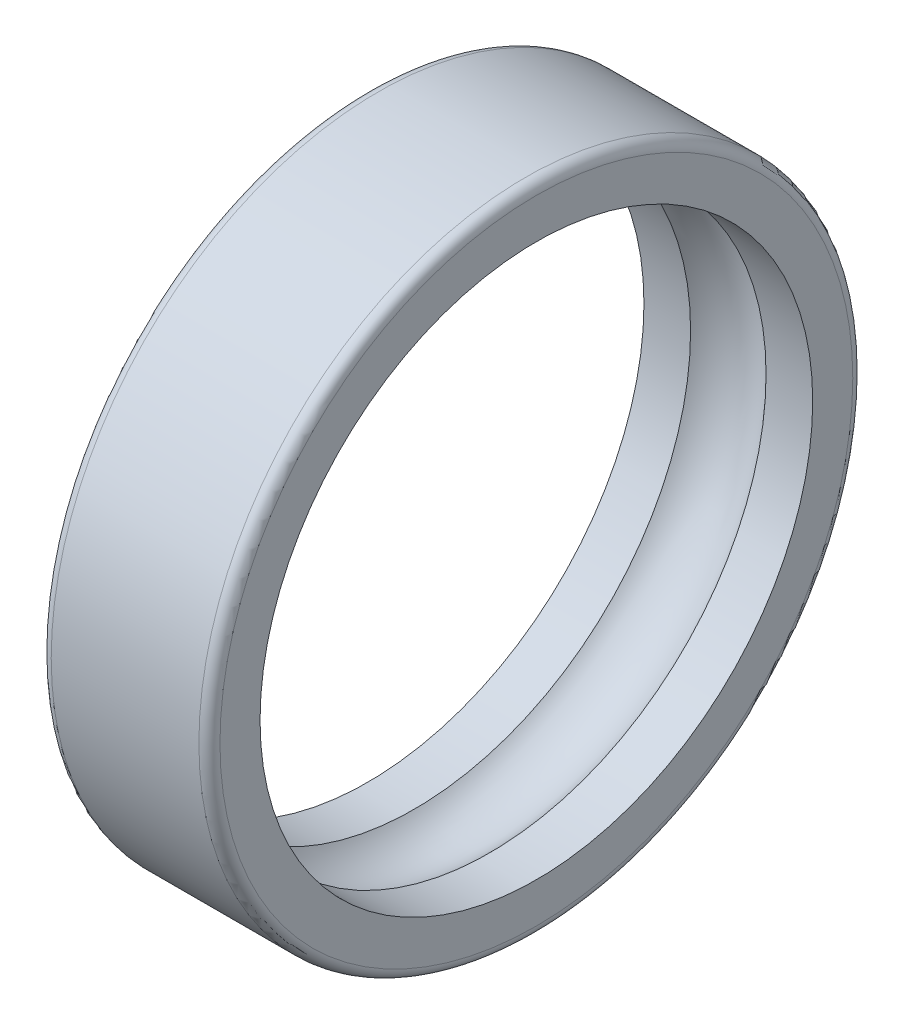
ISO-10303-21;
HEADER;
FILE_DESCRIPTION(('STEP AP214'),'2;1');
FILE_NAME('part.step','',(''),(''),'','','');
FILE_SCHEMA(('AUTOMOTIVE_DESIGN { 1 0 10303 214 1 1 1 1 }'));
ENDSEC;
DATA;
#1=APPLICATION_CONTEXT('core data for automotive mechanical design processes');
#2=APPLICATION_PROTOCOL_DEFINITION('international standard','automotive_design',2000,#1);
#3=PRODUCT_CONTEXT('',#1,'mechanical');
#4=PRODUCT('Part','Part','',(#3));
#5=PRODUCT_RELATED_PRODUCT_CATEGORY('part','',(#4));
#6=PRODUCT_DEFINITION_FORMATION('','',#4);
#7=PRODUCT_DEFINITION_CONTEXT('part definition',#1,'design');
#8=PRODUCT_DEFINITION('design','',#6,#7);
#9=PRODUCT_DEFINITION_SHAPE('','',#8);
#10=(LENGTH_UNIT() NAMED_UNIT(*) SI_UNIT(.MILLI.,.METRE.));
#11=(NAMED_UNIT(*) PLANE_ANGLE_UNIT() SI_UNIT($,.RADIAN.));
#12=(NAMED_UNIT(*) SI_UNIT($,.STERADIAN.) SOLID_ANGLE_UNIT());
#13=UNCERTAINTY_MEASURE_WITH_UNIT(LENGTH_MEASURE(1.E-05),#10,'distance_accuracy_value','');
#14=(GEOMETRIC_REPRESENTATION_CONTEXT(3) GLOBAL_UNCERTAINTY_ASSIGNED_CONTEXT((#13)) GLOBAL_UNIT_ASSIGNED_CONTEXT((#10,
#11,#12)) REPRESENTATION_CONTEXT('',''));
#15=CARTESIAN_POINT('',(0.,0.,0.));
#16=DIRECTION('',(0.,0.,1.));
#17=DIRECTION('',(1.,0.,0.));
#18=AXIS2_PLACEMENT_3D('',#15,#16,#17);
#19=CARTESIAN_POINT('',(0.999999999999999,0.,0.));
#20=DIRECTION('',(-1.,0.,0.));
#21=DIRECTION('',(0.,0.,1.));
#22=AXIS2_PLACEMENT_3D('',#19,#20,#21);
#23=TOROIDAL_SURFACE('',#22,30.,1.);
#24=CARTESIAN_POINT('',(0.,0.,0.));
#25=DIRECTION('',(-1.,0.,0.));
#26=DIRECTION('',(0.,0.,1.));
#27=AXIS2_PLACEMENT_3D('',#24,#25,#26);
#28=CIRCLE('',#27,30.);
#29=CARTESIAN_POINT('',(0.,0.,30.));
#30=VERTEX_POINT('',#29);
#31=EDGE_CURVE('E10',#30,#30,#28,.T.);
#32=ORIENTED_EDGE('',*,*,#31,.F.);
#33=EDGE_LOOP('',(#32));
#34=FACE_BOUND('',#33,.T.);
#35=CARTESIAN_POINT('',(0.999999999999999,0.,0.));
#36=DIRECTION('',(-1.,0.,0.));
#37=DIRECTION('',(0.,0.,1.));
#38=AXIS2_PLACEMENT_3D('',#35,#36,#37);
#39=CIRCLE('',#38,31.);
#40=CARTESIAN_POINT('',(0.999999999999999,0.,31.));
#41=VERTEX_POINT('',#40);
#42=EDGE_CURVE('E57',#41,#41,#39,.T.);
#43=ORIENTED_EDGE('',*,*,#42,.T.);
#44=EDGE_LOOP('',(#43));
#45=FACE_BOUND('',#44,.T.);
#46=ADVANCED_FACE('F29',(#34,#45),#23,.T.);
#47=CARTESIAN_POINT('',(0.,0.,-30.));
#48=DIRECTION('',(1.,0.,0.));
#49=DIRECTION('',(0.,0.,-1.));
#50=AXIS2_PLACEMENT_3D('',#47,#48,#49);
#51=PLANE('',#50);
#52=CARTESIAN_POINT('',(0.,0.,0.));
#53=DIRECTION('',(-1.,0.,0.));
#54=DIRECTION('',(0.,0.,1.));
#55=AXIS2_PLACEMENT_3D('',#52,#53,#54);
#56=CIRCLE('',#55,26.2);
#57=CARTESIAN_POINT('',(0.,0.,26.2));
#58=VERTEX_POINT('',#57);
#59=EDGE_CURVE('E35',#58,#58,#56,.T.);
#60=ORIENTED_EDGE('',*,*,#59,.F.);
#61=EDGE_LOOP('',(#60));
#62=FACE_BOUND('',#61,.T.);
#63=ORIENTED_EDGE('',*,*,#31,.T.);
#64=EDGE_LOOP('',(#63));
#65=FACE_BOUND('',#64,.T.);
#66=ADVANCED_FACE('F94',(#62,#65),#51,.F.);
#67=CARTESIAN_POINT('',(0.,0.,0.));
#68=DIRECTION('',(-1.,0.,0.));
#69=DIRECTION('',(0.,0.,1.));
#70=AXIS2_PLACEMENT_3D('',#67,#68,#69);
#71=CYLINDRICAL_SURFACE('',#70,26.2);
#72=CARTESIAN_POINT('',(4.42229123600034,0.,0.));
#73=DIRECTION('',(-1.,0.,0.));
#74=DIRECTION('',(0.,0.,1.));
#75=AXIS2_PLACEMENT_3D('',#72,#73,#74);
#76=CIRCLE('',#75,26.2);
#77=CARTESIAN_POINT('',(4.42229123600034,0.,26.2));
#78=VERTEX_POINT('',#77);
#79=EDGE_CURVE('E39',#78,#78,#76,.T.);
#80=ORIENTED_EDGE('',*,*,#79,.F.);
#81=EDGE_LOOP('',(#80));
#82=FACE_BOUND('',#81,.T.);
#83=ORIENTED_EDGE('',*,*,#59,.T.);
#84=EDGE_LOOP('',(#83));
#85=FACE_BOUND('',#84,.T.);
#86=ADVANCED_FACE('F89',(#82,#85),#71,.F.);
#87=CARTESIAN_POINT('',(8.,0.,0.));
#88=DIRECTION('',(-1.,0.,0.));
#89=DIRECTION('',(0.,0.,1.));
#90=AXIS2_PLACEMENT_3D('',#87,#88,#89);
#91=TOROIDAL_SURFACE('',#90,23.,4.8);
#92=CARTESIAN_POINT('',(11.5777087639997,0.,0.));
#93=DIRECTION('',(-1.,0.,0.));
#94=DIRECTION('',(0.,0.,1.));
#95=AXIS2_PLACEMENT_3D('',#92,#93,#94);
#96=CIRCLE('',#95,26.2);
#97=CARTESIAN_POINT('',(11.5777087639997,0.,26.2));
#98=VERTEX_POINT('',#97);
#99=EDGE_CURVE('E43',#98,#98,#96,.T.);
#100=ORIENTED_EDGE('',*,*,#99,.F.);
#101=EDGE_LOOP('',(#100));
#102=FACE_BOUND('',#101,.T.);
#103=ORIENTED_EDGE('',*,*,#79,.T.);
#104=EDGE_LOOP('',(#103));
#105=FACE_BOUND('',#104,.T.);
#106=ADVANCED_FACE('F83',(#102,#105),#91,.F.);
#107=CARTESIAN_POINT('',(0.,0.,0.));
#108=DIRECTION('',(-1.,0.,0.));
#109=DIRECTION('',(0.,0.,1.));
#110=AXIS2_PLACEMENT_3D('',#107,#108,#109);
#111=CYLINDRICAL_SURFACE('',#110,26.2);
#112=CARTESIAN_POINT('',(16.,0.,0.));
#113=DIRECTION('',(-1.,0.,0.));
#114=DIRECTION('',(0.,0.,1.));
#115=AXIS2_PLACEMENT_3D('',#112,#113,#114);
#116=CIRCLE('',#115,26.2);
#117=CARTESIAN_POINT('',(16.,0.,26.2));
#118=VERTEX_POINT('',#117);
#119=EDGE_CURVE('E48',#118,#118,#116,.T.);
#120=ORIENTED_EDGE('',*,*,#119,.F.);
#121=EDGE_LOOP('',(#120));
#122=FACE_BOUND('',#121,.T.);
#123=ORIENTED_EDGE('',*,*,#99,.T.);
#124=EDGE_LOOP('',(#123));
#125=FACE_BOUND('',#124,.T.);
#126=ADVANCED_FACE('F77',(#122,#125),#111,.F.);
#127=CARTESIAN_POINT('',(16.,0.,-30.));
#128=DIRECTION('',(-1.,0.,0.));
#129=DIRECTION('',(0.,0.,1.));
#130=AXIS2_PLACEMENT_3D('',#127,#128,#129);
#131=PLANE('',#130);
#132=CARTESIAN_POINT('',(16.,0.,0.));
#133=DIRECTION('',(-1.,0.,0.));
#134=DIRECTION('',(0.,0.,1.));
#135=AXIS2_PLACEMENT_3D('',#132,#133,#134);
#136=CIRCLE('',#135,30.);
#137=CARTESIAN_POINT('',(16.,0.,30.));
#138=VERTEX_POINT('',#137);
#139=EDGE_CURVE('E51',#138,#138,#136,.T.);
#140=ORIENTED_EDGE('',*,*,#139,.F.);
#141=EDGE_LOOP('',(#140));
#142=FACE_BOUND('',#141,.T.);
#143=ORIENTED_EDGE('',*,*,#119,.T.);
#144=EDGE_LOOP('',(#143));
#145=FACE_BOUND('',#144,.T.);
#146=ADVANCED_FACE('F71',(#142,#145),#131,.F.);
#147=CARTESIAN_POINT('',(15.,0.,0.));
#148=DIRECTION('',(-1.,0.,0.));
#149=DIRECTION('',(0.,0.,1.));
#150=AXIS2_PLACEMENT_3D('',#147,#148,#149);
#151=TOROIDAL_SURFACE('',#150,30.,1.);
#152=CARTESIAN_POINT('',(15.,0.,0.));
#153=DIRECTION('',(-1.,0.,0.));
#154=DIRECTION('',(0.,0.,1.));
#155=AXIS2_PLACEMENT_3D('',#152,#153,#154);
#156=CIRCLE('',#155,31.);
#157=CARTESIAN_POINT('',(15.,0.,31.));
#158=VERTEX_POINT('',#157);
#159=EDGE_CURVE('E54',#158,#158,#156,.T.);
#160=ORIENTED_EDGE('',*,*,#159,.F.);
#161=EDGE_LOOP('',(#160));
#162=FACE_BOUND('',#161,.T.);
#163=ORIENTED_EDGE('',*,*,#139,.T.);
#164=EDGE_LOOP('',(#163));
#165=FACE_BOUND('',#164,.T.);
#166=ADVANCED_FACE('F65',(#162,#165),#151,.T.);
#167=CARTESIAN_POINT('',(0.,0.,0.));
#168=DIRECTION('',(-1.,0.,0.));
#169=DIRECTION('',(0.,0.,1.));
#170=AXIS2_PLACEMENT_3D('',#167,#168,#169);
#171=CYLINDRICAL_SURFACE('',#170,31.);
#172=ORIENTED_EDGE('',*,*,#42,.F.);
#173=EDGE_LOOP('',(#172));
#174=FACE_BOUND('',#173,.T.);
#175=ORIENTED_EDGE('',*,*,#159,.T.);
#176=EDGE_LOOP('',(#175));
#177=FACE_BOUND('',#176,.T.);
#178=ADVANCED_FACE('F62',(#174,#177),#171,.T.);
#179=CLOSED_SHELL('',(#46,#66,#86,#106,#126,#146,#166,#178));
#180=MANIFOLD_SOLID_BREP('B2',#179);
#181=ADVANCED_BREP_SHAPE_REPRESENTATION('',(#18,#180),#14);
#182=SHAPE_DEFINITION_REPRESENTATION(#9,#181);
ENDSEC;
END-ISO-10303-21;
